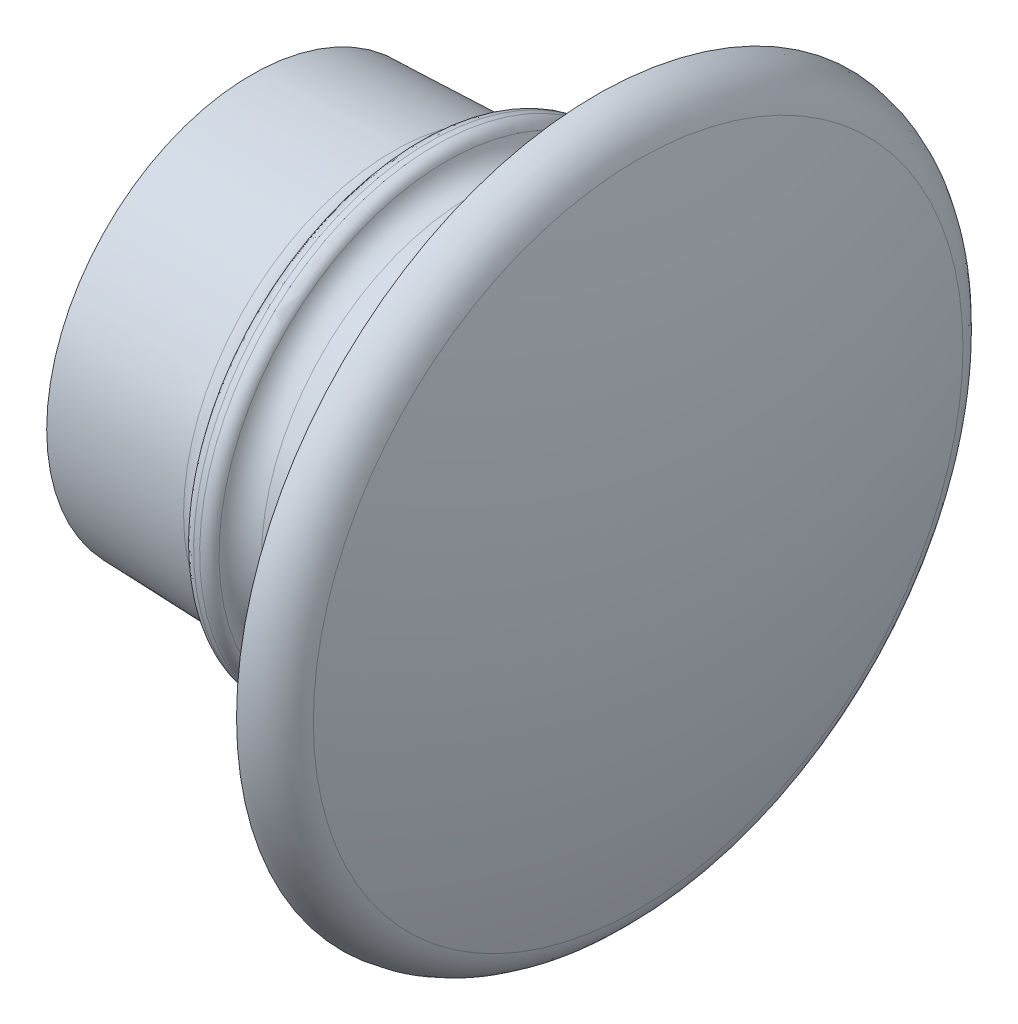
ISO-10303-21;
HEADER;
FILE_DESCRIPTION(('STEP AP214'),'2;1');
FILE_NAME('part.step','',(''),(''),'','','');
FILE_SCHEMA(('AUTOMOTIVE_DESIGN { 1 0 10303 214 1 1 1 1 }'));
ENDSEC;
DATA;
#1=APPLICATION_CONTEXT('core data for automotive mechanical design processes');
#2=APPLICATION_PROTOCOL_DEFINITION('international standard','automotive_design',2000,#1);
#3=PRODUCT_CONTEXT('',#1,'mechanical');
#4=PRODUCT('Part','Part','',(#3));
#5=PRODUCT_RELATED_PRODUCT_CATEGORY('part','',(#4));
#6=PRODUCT_DEFINITION_FORMATION('','',#4);
#7=PRODUCT_DEFINITION_CONTEXT('part definition',#1,'design');
#8=PRODUCT_DEFINITION('design','',#6,#7);
#9=PRODUCT_DEFINITION_SHAPE('','',#8);
#10=(LENGTH_UNIT() NAMED_UNIT(*) SI_UNIT(.MILLI.,.METRE.));
#11=(NAMED_UNIT(*) PLANE_ANGLE_UNIT() SI_UNIT($,.RADIAN.));
#12=(NAMED_UNIT(*) SI_UNIT($,.STERADIAN.) SOLID_ANGLE_UNIT());
#13=UNCERTAINTY_MEASURE_WITH_UNIT(LENGTH_MEASURE(1.E-05),#10,'distance_accuracy_value','');
#14=(GEOMETRIC_REPRESENTATION_CONTEXT(3) GLOBAL_UNCERTAINTY_ASSIGNED_CONTEXT((#13)) GLOBAL_UNIT_ASSIGNED_CONTEXT((#10,
#11,#12)) REPRESENTATION_CONTEXT('',''));
#15=CARTESIAN_POINT('',(0.,0.,0.));
#16=DIRECTION('',(0.,0.,1.));
#17=DIRECTION('',(1.,0.,0.));
#18=AXIS2_PLACEMENT_3D('',#15,#16,#17);
#19=CARTESIAN_POINT('',(14.,0.,0.));
#20=DIRECTION('',(-1.,0.,0.));
#21=DIRECTION('',(0.,0.,1.));
#22=AXIS2_PLACEMENT_3D('',#19,#20,#21);
#23=CYLINDRICAL_SURFACE('',#22,8.75);
#24=CARTESIAN_POINT('',(14.,0.,0.));
#25=DIRECTION('',(1.,0.,0.));
#26=DIRECTION('',(0.,0.,-1.));
#27=AXIS2_PLACEMENT_3D('',#24,#25,#26);
#28=CIRCLE('',#27,8.75);
#29=CARTESIAN_POINT('',(14.,0.,-8.75));
#30=VERTEX_POINT('',#29);
#31=EDGE_CURVE('E57',#30,#30,#28,.T.);
#32=ORIENTED_EDGE('',*,*,#31,.F.);
#33=EDGE_LOOP('',(#32));
#34=FACE_BOUND('',#33,.T.);
#35=CARTESIAN_POINT('',(9.16317810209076,0.,0.));
#36=DIRECTION('',(1.,0.,0.));
#37=DIRECTION('',(0.,1.,0.));
#38=AXIS2_PLACEMENT_3D('',#35,#36,#37);
#39=CIRCLE('',#38,8.75);
#40=CARTESIAN_POINT('',(9.16317810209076,8.75,0.));
#41=VERTEX_POINT('',#40);
#42=EDGE_CURVE('E52',#41,#41,#39,.F.);
#43=ORIENTED_EDGE('',*,*,#42,.F.);
#44=EDGE_LOOP('',(#43));
#45=FACE_BOUND('',#44,.T.);
#46=ADVANCED_FACE('F38',(#34,#45),#23,.T.);
#47=CARTESIAN_POINT('',(16.3758755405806,0.,0.));
#48=DIRECTION('',(-1.,0.,0.));
#49=DIRECTION('',(0.,0.,1.));
#50=AXIS2_PLACEMENT_3D('',#47,#48,#49);
#51=TOROIDAL_SURFACE('',#50,12.2902693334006,2.);
#52=CARTESIAN_POINT('',(14.4583936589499,0.,0.));
#53=DIRECTION('',(-1.,0.,0.));
#54=DIRECTION('',(0.,0.,1.));
#55=AXIS2_PLACEMENT_3D('',#52,#53,#54);
#56=CIRCLE('',#55,11.7217069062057);
#57=CARTESIAN_POINT('',(14.4583936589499,0.,11.7217069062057));
#58=VERTEX_POINT('',#57);
#59=EDGE_CURVE('E69',#58,#58,#56,.T.);
#60=ORIENTED_EDGE('',*,*,#59,.F.);
#61=EDGE_LOOP('',(#60));
#62=FACE_BOUND('',#61,.T.);
#63=CARTESIAN_POINT('',(14.3758755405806,0.,0.));
#64=DIRECTION('',(-1.,0.,0.));
#65=DIRECTION('',(0.,0.,1.));
#66=AXIS2_PLACEMENT_3D('',#63,#64,#65);
#67=CIRCLE('',#66,12.2902693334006);
#68=CARTESIAN_POINT('',(14.3758755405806,0.,12.2902693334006));
#69=VERTEX_POINT('',#68);
#70=EDGE_CURVE('E60',#69,#69,#67,.T.);
#71=ORIENTED_EDGE('',*,*,#70,.T.);
#72=EDGE_LOOP('',(#71));
#73=FACE_BOUND('',#72,.T.);
#74=ADVANCED_FACE('F113',(#62,#73),#51,.T.);
#75=CARTESIAN_POINT('',(14.3758755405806,0.,-15.));
#76=DIRECTION('',(1.,0.,0.));
#77=DIRECTION('',(0.,0.,-1.));
#78=AXIS2_PLACEMENT_3D('',#75,#76,#77);
#79=PLANE('',#78);
#80=ORIENTED_EDGE('',*,*,#70,.F.);
#81=EDGE_LOOP('',(#80));
#82=FACE_BOUND('',#81,.T.);
#83=CARTESIAN_POINT('',(14.3758755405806,0.,0.));
#84=DIRECTION('',(-1.,0.,0.));
#85=DIRECTION('',(0.,0.,1.));
#86=AXIS2_PLACEMENT_3D('',#83,#84,#85);
#87=CIRCLE('',#86,15.);
#88=CARTESIAN_POINT('',(14.3758755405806,0.,15.));
#89=VERTEX_POINT('',#88);
#90=EDGE_CURVE('E63',#89,#89,#87,.T.);
#91=ORIENTED_EDGE('',*,*,#90,.T.);
#92=EDGE_LOOP('',(#91));
#93=FACE_BOUND('',#92,.T.);
#94=ADVANCED_FACE('F118',(#82,#93),#79,.F.);
#95=CARTESIAN_POINT('',(-32.,0.,0.));
#96=DIRECTION('',(-1.,0.,0.));
#97=DIRECTION('',(0.,0.,-1.));
#98=AXIS2_PLACEMENT_3D('',#95,#96,#97);
#99=SPHERICAL_SURFACE('',#98,50.);
#100=CARTESIAN_POINT('',(16.1291430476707,0.,0.));
#101=DIRECTION('',(-1.,0.,0.));
#102=DIRECTION('',(0.,0.,1.));
#103=AXIS2_PLACEMENT_3D('',#100,#101,#102);
#104=CIRCLE('',#103,13.549375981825);
#105=CARTESIAN_POINT('',(16.1291430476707,0.,13.549375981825));
#106=VERTEX_POINT('',#105);
#107=EDGE_CURVE('E48',#106,#106,#104,.F.);
#108=ORIENTED_EDGE('',*,*,#107,.T.);
#109=EDGE_LOOP('',(#108));
#110=FACE_BOUND('',#109,.T.);
#111=ADVANCED_FACE('F156',(#110),#99,.T.);
#112=CARTESIAN_POINT('',(14.,0.,0.));
#113=DIRECTION('',(-1.,0.,0.));
#114=DIRECTION('',(0.,0.,1.));
#115=AXIS2_PLACEMENT_3D('',#112,#113,#114);
#116=TOROIDAL_SURFACE('',#115,9.75,0.999999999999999);
#117=ORIENTED_EDGE('',*,*,#31,.T.);
#118=EDGE_LOOP('',(#117));
#119=FACE_BOUND('',#118,.T.);
#120=CARTESIAN_POINT('',(14.9587409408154,0.,0.));
#121=DIRECTION('',(-1.,0.,0.));
#122=DIRECTION('',(0.,0.,1.));
#123=AXIS2_PLACEMENT_3D('',#120,#121,#122);
#124=CIRCLE('',#123,10.0342812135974);
#125=CARTESIAN_POINT('',(14.9587409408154,0.,10.0342812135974));
#126=VERTEX_POINT('',#125);
#127=EDGE_CURVE('E66',#126,#126,#124,.T.);
#128=ORIENTED_EDGE('',*,*,#127,.T.);
#129=EDGE_LOOP('',(#128));
#130=FACE_BOUND('',#129,.T.);
#131=ADVANCED_FACE('F152',(#119,#130),#116,.F.);
#132=CARTESIAN_POINT('',(14.4583936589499,0.,0.));
#133=DIRECTION('',(-1.,0.,0.));
#134=DIRECTION('',(0.,0.,1.));
#135=AXIS2_PLACEMENT_3D('',#132,#133,#134);
#136=CONICAL_SURFACE('',#135,11.7217069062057,1.28253970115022);
#137=ORIENTED_EDGE('',*,*,#127,.F.);
#138=EDGE_LOOP('',(#137));
#139=FACE_BOUND('',#138,.T.);
#140=ORIENTED_EDGE('',*,*,#59,.T.);
#141=EDGE_LOOP('',(#140));
#142=FACE_BOUND('',#141,.T.);
#143=ADVANCED_FACE('F138',(#139,#142),#136,.F.);
#144=CARTESIAN_POINT('',(5.9,0.,0.));
#145=DIRECTION('',(-1.,0.,0.));
#146=DIRECTION('',(0.,-1.,0.));
#147=AXIS2_PLACEMENT_3D('',#144,#145,#146);
#148=TOROIDAL_SURFACE('',#147,9.84987684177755,1.1);
#149=CARTESIAN_POINT('',(6.93926046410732,0.,0.));
#150=DIRECTION('',(-1.,0.,0.));
#151=DIRECTION('',(0.,-1.,0.));
#152=AXIS2_PLACEMENT_3D('',#149,#150,#151);
#153=CIRCLE('',#152,9.48940813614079);
#154=CARTESIAN_POINT('',(6.93926046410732,-9.48940813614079,0.));
#155=VERTEX_POINT('',#154);
#156=EDGE_CURVE('E72',#155,#155,#153,.T.);
#157=ORIENTED_EDGE('',*,*,#156,.T.);
#158=EDGE_LOOP('',(#157));
#159=FACE_BOUND('',#158,.T.);
#160=CARTESIAN_POINT('',(5.91646004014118,0.,0.));
#161=DIRECTION('',(-1.,0.,0.));
#162=DIRECTION('',(0.,0.,1.));
#163=AXIS2_PLACEMENT_3D('',#160,#161,#162);
#164=CIRCLE('',#163,8.75);
#165=CARTESIAN_POINT('',(5.91646004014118,0.,8.75));
#166=VERTEX_POINT('',#165);
#167=EDGE_CURVE('E87',#166,#166,#164,.T.);
#168=ORIENTED_EDGE('',*,*,#167,.F.);
#169=EDGE_LOOP('',(#168));
#170=FACE_BOUND('',#169,.T.);
#171=ADVANCED_FACE('F128',(#159,#170),#148,.F.);
#172=CARTESIAN_POINT('',(9.17335903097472,0.,0.));
#173=DIRECTION('',(-1.,0.,0.));
#174=DIRECTION('',(0.,-1.,0.));
#175=AXIS2_PLACEMENT_3D('',#172,#173,#174);
#176=TOROIDAL_SURFACE('',#175,9.84995288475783,1.1);
#177=CARTESIAN_POINT('',(8.13411670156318,0.,0.));
#178=DIRECTION('',(-1.,0.,0.));
#179=DIRECTION('',(0.,-1.,0.));
#180=AXIS2_PLACEMENT_3D('',#177,#178,#179);
#181=CIRCLE('',#180,9.48943189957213);
#182=CARTESIAN_POINT('',(8.13411670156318,-9.48943189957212,0.));
#183=VERTEX_POINT('',#182);
#184=EDGE_CURVE('E81',#183,#183,#181,.T.);
#185=ORIENTED_EDGE('',*,*,#184,.F.);
#186=EDGE_LOOP('',(#185));
#187=FACE_BOUND('',#186,.T.);
#188=ORIENTED_EDGE('',*,*,#42,.T.);
#189=EDGE_LOOP('',(#188));
#190=FACE_BOUND('',#189,.T.);
#191=ADVANCED_FACE('F125',(#187,#190),#176,.F.);
#192=CARTESIAN_POINT('',(7.4116515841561,0.,0.));
#193=DIRECTION('',(-1.,0.,0.));
#194=DIRECTION('',(0.,-1.,0.));
#195=AXIS2_PLACEMENT_3D('',#192,#193,#194);
#196=TOROIDAL_SURFACE('',#195,9.32555872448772,0.5);
#197=ORIENTED_EDGE('',*,*,#156,.F.);
#198=EDGE_LOOP('',(#197));
#199=FACE_BOUND('',#198,.T.);
#200=CARTESIAN_POINT('',(7.4116515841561,0.,0.));
#201=DIRECTION('',(-1.,0.,0.));
#202=DIRECTION('',(0.,-1.,0.));
#203=AXIS2_PLACEMENT_3D('',#200,#201,#202);
#204=CIRCLE('',#203,9.82555872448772);
#205=CARTESIAN_POINT('',(7.4116515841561,-9.82555872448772,0.));
#206=VERTEX_POINT('',#205);
#207=EDGE_CURVE('E75',#206,#206,#204,.T.);
#208=ORIENTED_EDGE('',*,*,#207,.T.);
#209=EDGE_LOOP('',(#208));
#210=FACE_BOUND('',#209,.T.);
#211=ADVANCED_FACE('F127',(#199,#210),#196,.T.);
#212=CARTESIAN_POINT('',(-2.79962348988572,0.,0.));
#213=DIRECTION('',(-1.,0.,0.));
#214=DIRECTION('',(0.,-1.,0.));
#215=AXIS2_PLACEMENT_3D('',#212,#213,#214);
#216=CYLINDRICAL_SURFACE('',#215,9.82555872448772);
#217=ORIENTED_EDGE('',*,*,#207,.F.);
#218=EDGE_LOOP('',(#217));
#219=FACE_BOUND('',#218,.T.);
#220=CARTESIAN_POINT('',(7.66173382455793,0.,0.));
#221=DIRECTION('',(-1.,0.,0.));
#222=DIRECTION('',(0.,-1.,0.));
#223=AXIS2_PLACEMENT_3D('',#220,#221,#222);
#224=CIRCLE('',#223,9.82555872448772);
#225=CARTESIAN_POINT('',(7.66173382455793,-9.82555872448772,0.));
#226=VERTEX_POINT('',#225);
#227=EDGE_CURVE('E78',#226,#226,#224,.T.);
#228=ORIENTED_EDGE('',*,*,#227,.T.);
#229=EDGE_LOOP('',(#228));
#230=FACE_BOUND('',#229,.T.);
#231=ADVANCED_FACE('F135',(#219,#230),#216,.T.);
#232=CARTESIAN_POINT('',(7.66173382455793,0.,0.));
#233=DIRECTION('',(-1.,0.,0.));
#234=DIRECTION('',(0.,-1.,0.));
#235=AXIS2_PLACEMENT_3D('',#232,#233,#234);
#236=TOROIDAL_SURFACE('',#235,9.32555872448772,0.500000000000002);
#237=ORIENTED_EDGE('',*,*,#227,.F.);
#238=EDGE_LOOP('',(#237));
#239=FACE_BOUND('',#238,.T.);
#240=ORIENTED_EDGE('',*,*,#184,.T.);
#241=EDGE_LOOP('',(#240));
#242=FACE_BOUND('',#241,.T.);
#243=ADVANCED_FACE('F108',(#239,#242),#236,.T.);
#244=CARTESIAN_POINT('',(14.2039773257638,0.,0.));
#245=DIRECTION('',(1.,0.,0.));
#246=DIRECTION('',(0.,0.,-1.));
#247=AXIS2_PLACEMENT_3D('',#244,#245,#246);
#248=TOROIDAL_SURFACE('',#247,13.007400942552,2.);
#249=ORIENTED_EDGE('',*,*,#107,.F.);
#250=EDGE_LOOP('',(#249));
#251=FACE_BOUND('',#250,.T.);
#252=ORIENTED_EDGE('',*,*,#90,.F.);
#253=EDGE_LOOP('',(#252));
#254=FACE_BOUND('',#253,.T.);
#255=ADVANCED_FACE('F99',(#251,#254),#248,.T.);
#256=CARTESIAN_POINT('',(0.,0.,0.));
#257=DIRECTION('',(1.,0.,0.));
#258=DIRECTION('',(0.,0.,-1.));
#259=AXIS2_PLACEMENT_3D('',#256,#257,#258);
#260=CONICAL_SURFACE('',#259,8.54339266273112,0.0349065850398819);
#261=ORIENTED_EDGE('',*,*,#167,.T.);
#262=EDGE_LOOP('',(#261));
#263=FACE_BOUND('',#262,.T.);
#264=CARTESIAN_POINT('',(0.,0.,0.));
#265=DIRECTION('',(-1.,0.,0.));
#266=DIRECTION('',(0.,0.,1.));
#267=AXIS2_PLACEMENT_3D('',#264,#265,#266);
#268=CIRCLE('',#267,8.54339266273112);
#269=CARTESIAN_POINT('',(0.,0.,8.54339266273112));
#270=VERTEX_POINT('',#269);
#271=EDGE_CURVE('E90',#270,#270,#268,.T.);
#272=ORIENTED_EDGE('',*,*,#271,.F.);
#273=EDGE_LOOP('',(#272));
#274=FACE_BOUND('',#273,.T.);
#275=ADVANCED_FACE('F96',(#263,#274),#260,.T.);
#276=CARTESIAN_POINT('',(-32.,0.,0.));
#277=DIRECTION('',(1.,0.,0.));
#278=DIRECTION('',(0.,0.,1.));
#279=AXIS2_PLACEMENT_3D('',#276,#277,#278);
#280=SPHERICAL_SURFACE('',#279,48.3758755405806);
#281=CARTESIAN_POINT('',(16.0934982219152,0.,0.));
#282=DIRECTION('',(-1.,0.,0.));
#283=DIRECTION('',(0.,0.,1.));
#284=AXIS2_PLACEMENT_3D('',#281,#282,#283);
#285=CIRCLE('',#284,5.21926844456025);
#286=CARTESIAN_POINT('',(16.0934982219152,0.,5.21926844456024));
#287=VERTEX_POINT('',#286);
#288=EDGE_CURVE('E12',#287,#287,#285,.T.);
#289=ORIENTED_EDGE('',*,*,#288,.T.);
#290=EDGE_LOOP('',(#289));
#291=FACE_BOUND('',#290,.T.);
#292=ADVANCED_FACE('F98',(#291),#280,.F.);
#293=CARTESIAN_POINT('',(15.8706897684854,0.,0.));
#294=DIRECTION('',(-1.,0.,0.));
#295=DIRECTION('',(0.,0.,1.));
#296=AXIS2_PLACEMENT_3D('',#293,#294,#295);
#297=CONICAL_SURFACE('',#296,6.9729760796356,0.017453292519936);
#298=CARTESIAN_POINT('',(14.140077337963,0.,0.));
#299=DIRECTION('',(-1.,0.,0.));
#300=DIRECTION('',(0.,0.,1.));
#301=AXIS2_PLACEMENT_3D('',#298,#299,#300);
#302=CIRCLE('',#301,7.00318403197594);
#303=CARTESIAN_POINT('',(14.140077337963,0.,7.00318403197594));
#304=VERTEX_POINT('',#303);
#305=EDGE_CURVE('E44',#304,#304,#302,.F.);
#306=ORIENTED_EDGE('',*,*,#305,.T.);
#307=EDGE_LOOP('',(#306));
#308=FACE_BOUND('',#307,.T.);
#309=CARTESIAN_POINT('',(0.,0.,0.));
#310=DIRECTION('',(1.,0.,0.));
#311=DIRECTION('',(0.,0.,-1.));
#312=AXIS2_PLACEMENT_3D('',#309,#310,#311);
#313=CIRCLE('',#312,7.25);
#314=CARTESIAN_POINT('',(0.,0.,-7.25));
#315=VERTEX_POINT('',#314);
#316=EDGE_CURVE('E84',#315,#315,#313,.T.);
#317=ORIENTED_EDGE('',*,*,#316,.F.);
#318=EDGE_LOOP('',(#317));
#319=FACE_BOUND('',#318,.T.);
#320=ADVANCED_FACE('F106',(#308,#319),#297,.F.);
#321=CARTESIAN_POINT('',(0.,0.,0.));
#322=DIRECTION('',(1.,0.,0.));
#323=DIRECTION('',(0.,0.,-1.));
#324=AXIS2_PLACEMENT_3D('',#321,#322,#323);
#325=PLANE('',#324);
#326=ORIENTED_EDGE('',*,*,#316,.T.);
#327=EDGE_LOOP('',(#326));
#328=FACE_BOUND('',#327,.T.);
#329=ORIENTED_EDGE('',*,*,#271,.T.);
#330=EDGE_LOOP('',(#329));
#331=FACE_BOUND('',#330,.T.);
#332=ADVANCED_FACE('F94',(#328,#331),#325,.F.);
#333=CARTESIAN_POINT('',(14.1051725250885,0.,0.));
#334=DIRECTION('',(-1.,0.,0.));
#335=DIRECTION('',(0.,0.,1.));
#336=AXIS2_PLACEMENT_3D('',#333,#334,#335);
#337=TOROIDAL_SURFACE('',#336,5.00348864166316,2.);
#338=ORIENTED_EDGE('',*,*,#288,.F.);
#339=EDGE_LOOP('',(#338));
#340=FACE_BOUND('',#339,.T.);
#341=ORIENTED_EDGE('',*,*,#305,.F.);
#342=EDGE_LOOP('',(#341));
#343=FACE_BOUND('',#342,.T.);
#344=ADVANCED_FACE('F164',(#340,#343),#337,.F.);
#345=CLOSED_SHELL('',(#46,#74,#94,#111,#131,#143,#171,#191,#211,#231,#243,#255,#275,#292,#320,
#332,#344));
#346=MANIFOLD_SOLID_BREP('B2',#345);
#347=ADVANCED_BREP_SHAPE_REPRESENTATION('',(#18,#346),#14);
#348=SHAPE_DEFINITION_REPRESENTATION(#9,#347);
ENDSEC;
END-ISO-10303-21;
